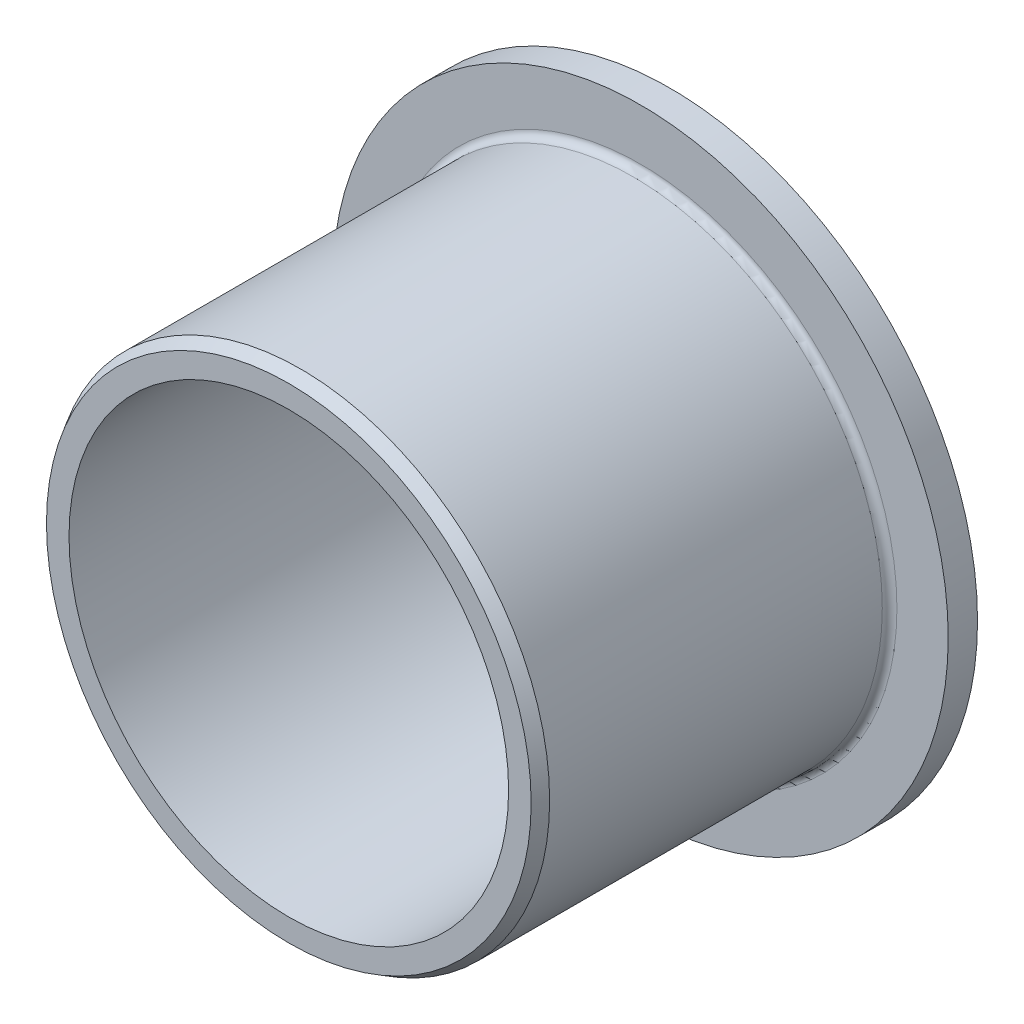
ISO-10303-21;
HEADER;
FILE_DESCRIPTION(('STEP AP214'),'2;1');
FILE_NAME('part.step','',(''),(''),'','','');
FILE_SCHEMA(('AUTOMOTIVE_DESIGN { 1 0 10303 214 1 1 1 1 }'));
ENDSEC;
DATA;
#1=APPLICATION_CONTEXT('core data for automotive mechanical design processes');
#2=APPLICATION_PROTOCOL_DEFINITION('international standard','automotive_design',2000,#1);
#3=PRODUCT_CONTEXT('',#1,'mechanical');
#4=PRODUCT('Part','Part','',(#3));
#5=PRODUCT_RELATED_PRODUCT_CATEGORY('part','',(#4));
#6=PRODUCT_DEFINITION_FORMATION('','',#4);
#7=PRODUCT_DEFINITION_CONTEXT('part definition',#1,'design');
#8=PRODUCT_DEFINITION('design','',#6,#7);
#9=PRODUCT_DEFINITION_SHAPE('','',#8);
#10=(LENGTH_UNIT() NAMED_UNIT(*) SI_UNIT(.MILLI.,.METRE.));
#11=(NAMED_UNIT(*) PLANE_ANGLE_UNIT() SI_UNIT($,.RADIAN.));
#12=(NAMED_UNIT(*) SI_UNIT($,.STERADIAN.) SOLID_ANGLE_UNIT());
#13=UNCERTAINTY_MEASURE_WITH_UNIT(LENGTH_MEASURE(1.E-05),#10,'distance_accuracy_value','');
#14=(GEOMETRIC_REPRESENTATION_CONTEXT(3) GLOBAL_UNCERTAINTY_ASSIGNED_CONTEXT((#13)) GLOBAL_UNIT_ASSIGNED_CONTEXT((#10,
#11,#12)) REPRESENTATION_CONTEXT('',''));
#15=CARTESIAN_POINT('',(0.,0.,0.));
#16=DIRECTION('',(0.,0.,1.));
#17=DIRECTION('',(1.,0.,0.));
#18=AXIS2_PLACEMENT_3D('',#15,#16,#17);
#19=CARTESIAN_POINT('',(0.,0.,26.));
#20=DIRECTION('',(0.,0.,1.));
#21=DIRECTION('',(1.,0.,0.));
#22=AXIS2_PLACEMENT_3D('',#19,#20,#21);
#23=PLANE('',#22);
#24=CARTESIAN_POINT('',(0.,0.,26.));
#25=DIRECTION('',(0.,0.,1.));
#26=DIRECTION('',(1.,0.,0.));
#27=AXIS2_PLACEMENT_3D('',#24,#25,#26);
#28=CIRCLE('',#27,16.5381197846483);
#29=CARTESIAN_POINT('',(16.5381197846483,0.,26.));
#30=VERTEX_POINT('',#29);
#31=EDGE_CURVE('E353',#30,#30,#28,.T.);
#32=ORIENTED_EDGE('',*,*,#31,.T.);
#33=EDGE_LOOP('',(#32));
#34=FACE_BOUND('',#33,.T.);
#35=CARTESIAN_POINT('',(0.,0.,26.));
#36=DIRECTION('',(0.,0.,1.));
#37=DIRECTION('',(1.,0.,0.));
#38=AXIS2_PLACEMENT_3D('',#35,#36,#37);
#39=CIRCLE('',#38,15.);
#40=CARTESIAN_POINT('',(-15.,0.,26.));
#41=VERTEX_POINT('',#40);
#42=EDGE_CURVE('E369',#41,#41,#39,.T.);
#43=ORIENTED_EDGE('',*,*,#42,.F.);
#44=EDGE_LOOP('',(#43));
#45=FACE_BOUND('',#44,.T.);
#46=ADVANCED_FACE('F346',(#34,#45),#23,.T.);
#47=CARTESIAN_POINT('',(0.,0.,26.));
#48=DIRECTION('',(0.,0.,-1.));
#49=DIRECTION('',(-1.,0.,0.));
#50=AXIS2_PLACEMENT_3D('',#47,#48,#49);
#51=CYLINDRICAL_SURFACE('',#50,21.);
#52=CARTESIAN_POINT('',(0.,0.,0.));
#53=DIRECTION('',(0.,0.,1.));
#54=DIRECTION('',(1.,0.,0.));
#55=AXIS2_PLACEMENT_3D('',#52,#53,#54);
#56=CIRCLE('',#55,21.);
#57=CARTESIAN_POINT('',(-21.,0.,0.));
#58=VERTEX_POINT('',#57);
#59=EDGE_CURVE('E366',#58,#58,#56,.T.);
#60=CARTESIAN_POINT('',(0.,0.,2.));
#61=DIRECTION('',(0.,0.,1.));
#62=DIRECTION('',(1.,0.,0.));
#63=AXIS2_PLACEMENT_3D('',#60,#61,#62);
#64=CIRCLE('',#63,21.);
#65=CARTESIAN_POINT('',(-21.,0.,1.99999999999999));
#66=VERTEX_POINT('',#65);
#67=EDGE_CURVE('E375',#66,#66,#64,.T.);
#68=CARTESIAN_POINT('',(-21.,0.,0.));
#69=CARTESIAN_POINT('',(-21.,0.,0.0208333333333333));
#70=CARTESIAN_POINT('',(-21.,0.,0.0416666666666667));
#71=CARTESIAN_POINT('',(-21.,0.,0.0833333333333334));
#72=CARTESIAN_POINT('',(-21.,0.,0.104166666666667));
#73=CARTESIAN_POINT('',(-21.,0.,0.145833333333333));
#74=CARTESIAN_POINT('',(-21.,0.,0.166666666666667));
#75=CARTESIAN_POINT('',(-21.,0.,0.208333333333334));
#76=CARTESIAN_POINT('',(-21.,0.,0.229166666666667));
#77=CARTESIAN_POINT('',(-21.,0.,0.270833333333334));
#78=CARTESIAN_POINT('',(-21.,0.,0.291666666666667));
#79=CARTESIAN_POINT('',(-21.,0.,0.333333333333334));
#80=CARTESIAN_POINT('',(-21.,0.,0.354166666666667));
#81=CARTESIAN_POINT('',(-21.,0.,0.395833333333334));
#82=CARTESIAN_POINT('',(-21.,0.,0.416666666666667));
#83=CARTESIAN_POINT('',(-21.,0.,0.458333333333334));
#84=CARTESIAN_POINT('',(-21.,0.,0.479166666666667));
#85=CARTESIAN_POINT('',(-21.,0.,0.520833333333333));
#86=CARTESIAN_POINT('',(-21.,0.,0.541666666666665));
#87=CARTESIAN_POINT('',(-21.,0.,0.58333333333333));
#88=CARTESIAN_POINT('',(-21.,0.,0.604166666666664));
#89=CARTESIAN_POINT('',(-21.,0.,0.64583333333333));
#90=CARTESIAN_POINT('',(-21.,0.,0.666666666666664));
#91=CARTESIAN_POINT('',(-21.,0.,0.70833333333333));
#92=CARTESIAN_POINT('',(-21.,0.,0.729166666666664));
#93=CARTESIAN_POINT('',(-21.,0.,0.77083333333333));
#94=CARTESIAN_POINT('',(-21.,0.,0.791666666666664));
#95=CARTESIAN_POINT('',(-21.,0.,0.833333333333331));
#96=CARTESIAN_POINT('',(-21.,0.,0.854166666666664));
#97=CARTESIAN_POINT('',(-21.,0.,0.895833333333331));
#98=CARTESIAN_POINT('',(-21.,0.,0.916666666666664));
#99=CARTESIAN_POINT('',(-21.,0.,0.958333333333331));
#100=CARTESIAN_POINT('',(-21.,0.,0.979166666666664));
#101=CARTESIAN_POINT('',(-21.,0.,1.02083333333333));
#102=CARTESIAN_POINT('',(-21.,0.,1.04166666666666));
#103=CARTESIAN_POINT('',(-21.,0.,1.08333333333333));
#104=CARTESIAN_POINT('',(-21.,0.,1.10416666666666));
#105=CARTESIAN_POINT('',(-21.,0.,1.14583333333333));
#106=CARTESIAN_POINT('',(-21.,0.,1.16666666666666));
#107=CARTESIAN_POINT('',(-21.,0.,1.20833333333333));
#108=CARTESIAN_POINT('',(-21.,0.,1.22916666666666));
#109=CARTESIAN_POINT('',(-21.,0.,1.27083333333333));
#110=CARTESIAN_POINT('',(-21.,0.,1.29166666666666));
#111=CARTESIAN_POINT('',(-21.,0.,1.33333333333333));
#112=CARTESIAN_POINT('',(-21.,0.,1.35416666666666));
#113=CARTESIAN_POINT('',(-21.,0.,1.39583333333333));
#114=CARTESIAN_POINT('',(-21.,0.,1.41666666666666));
#115=CARTESIAN_POINT('',(-21.,0.,1.45833333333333));
#116=CARTESIAN_POINT('',(-21.,0.,1.47916666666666));
#117=CARTESIAN_POINT('',(-21.,0.,1.52083333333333));
#118=CARTESIAN_POINT('',(-21.,0.,1.54166666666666));
#119=CARTESIAN_POINT('',(-21.,0.,1.58333333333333));
#120=CARTESIAN_POINT('',(-21.,0.,1.60416666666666));
#121=CARTESIAN_POINT('',(-21.,0.,1.64583333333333));
#122=CARTESIAN_POINT('',(-21.,0.,1.66666666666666));
#123=CARTESIAN_POINT('',(-21.,0.,1.70833333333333));
#124=CARTESIAN_POINT('',(-21.,0.,1.72916666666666));
#125=CARTESIAN_POINT('',(-21.,0.,1.77083333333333));
#126=CARTESIAN_POINT('',(-21.,0.,1.79166666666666));
#127=CARTESIAN_POINT('',(-21.,0.,1.83333333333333));
#128=CARTESIAN_POINT('',(-21.,0.,1.85416666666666));
#129=CARTESIAN_POINT('',(-21.,0.,1.89583333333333));
#130=CARTESIAN_POINT('',(-21.,0.,1.91666666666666));
#131=CARTESIAN_POINT('',(-21.,0.,1.95833333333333));
#132=CARTESIAN_POINT('',(-21.,0.,1.97916666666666));
#133=CARTESIAN_POINT('',(-21.,0.,1.99999999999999));
#134=B_SPLINE_CURVE_WITH_KNOTS('',3,(#68,#69,#70,#71,#72,#73,#74,#75,#76,#77,#78,#79,#80,#81,
#82,#83,#84,#85,#86,#87,#88,#89,#90,#91,#92,#93,#94,#95,#96,#97,#98,#99,#100,#101,#102,#103,
#104,#105,#106,#107,#108,#109,#110,#111,#112,#113,#114,#115,#116,#117,#118,#119,#120,#121,#122,
#123,#124,#125,#126,#127,#128,#129,#130,#131,#132,#133),.UNSPECIFIED.,.F.,.F.,(4,2,2,2,2,2,2,2,
2,2,2,2,2,2,2,2,2,2,2,2,2,2,2,2,2,2,2,2,2,2,2,2,4),(0.,0.0625000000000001,0.125,0.1875,0.25,
0.3125,0.375,0.4375,0.5,0.562499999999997,0.624999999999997,0.687499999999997,0.749999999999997,
0.812499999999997,0.874999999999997,0.937499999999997,0.999999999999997,1.0625,1.125,1.1875,
1.25,1.3125,1.375,1.4375,1.49999999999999,1.56249999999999,1.62499999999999,1.68749999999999,
1.74999999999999,1.81249999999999,1.87499999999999,1.93749999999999,1.99999999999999),.UNSPECIFIED.);
#135=EDGE_CURVE('BSEAM348',#58,#66,#134,.T.);
#136=ORIENTED_EDGE('',*,*,#59,.T.);
#137=ORIENTED_EDGE('',*,*,#67,.F.);
#138=ORIENTED_EDGE('',*,*,#135,.T.);
#139=ORIENTED_EDGE('',*,*,#135,.F.);
#140=EDGE_LOOP('',(#136,#138,#137,#139));
#141=FACE_BOUND('',#140,.T.);
#142=ADVANCED_FACE('F348',(#141),#51,.T.);
#143=CARTESIAN_POINT('',(0.,0.,0.));
#144=DIRECTION('',(0.,0.,1.));
#145=DIRECTION('',(1.,0.,0.));
#146=AXIS2_PLACEMENT_3D('',#143,#144,#145);
#147=PLANE('',#146);
#148=ORIENTED_EDGE('',*,*,#59,.F.);
#149=EDGE_LOOP('',(#148));
#150=FACE_BOUND('',#149,.T.);
#151=CARTESIAN_POINT('',(0.,0.,0.));
#152=DIRECTION('',(0.,0.,1.));
#153=DIRECTION('',(1.,0.,0.));
#154=AXIS2_PLACEMENT_3D('',#151,#152,#153);
#155=CIRCLE('',#154,15.);
#156=CARTESIAN_POINT('',(-15.,0.,0.));
#157=VERTEX_POINT('',#156);
#158=EDGE_CURVE('E372',#157,#157,#155,.T.);
#159=ORIENTED_EDGE('',*,*,#158,.T.);
#160=EDGE_LOOP('',(#159));
#161=FACE_BOUND('',#160,.T.);
#162=ADVANCED_FACE('F382',(#150,#161),#147,.F.);
#163=CARTESIAN_POINT('',(0.,0.,26.));
#164=DIRECTION('',(0.,0.,-1.));
#165=DIRECTION('',(-1.,0.,0.));
#166=AXIS2_PLACEMENT_3D('',#163,#164,#165);
#167=CYLINDRICAL_SURFACE('',#166,15.);
#168=CARTESIAN_POINT('',(-15.,0.,26.));
#169=CARTESIAN_POINT('',(-15.,0.,25.7291666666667));
#170=CARTESIAN_POINT('',(-15.,0.,25.4583333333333));
#171=CARTESIAN_POINT('',(-15.,0.,24.9166666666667));
#172=CARTESIAN_POINT('',(-15.,0.,24.6458333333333));
#173=CARTESIAN_POINT('',(-15.,0.,24.1041666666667));
#174=CARTESIAN_POINT('',(-15.,0.,23.8333333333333));
#175=CARTESIAN_POINT('',(-15.,0.,23.2916666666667));
#176=CARTESIAN_POINT('',(-15.,0.,23.0208333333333));
#177=CARTESIAN_POINT('',(-15.,0.,22.4791666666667));
#178=CARTESIAN_POINT('',(-15.,0.,22.2083333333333));
#179=CARTESIAN_POINT('',(-15.,0.,21.6666666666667));
#180=CARTESIAN_POINT('',(-15.,0.,21.3958333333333));
#181=CARTESIAN_POINT('',(-15.,0.,20.8541666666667));
#182=CARTESIAN_POINT('',(-15.,0.,20.5833333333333));
#183=CARTESIAN_POINT('',(-15.,0.,20.0416666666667));
#184=CARTESIAN_POINT('',(-15.,0.,19.7708333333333));
#185=CARTESIAN_POINT('',(-15.,0.,19.2291666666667));
#186=CARTESIAN_POINT('',(-15.,0.,18.9583333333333));
#187=CARTESIAN_POINT('',(-15.,0.,18.4166666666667));
#188=CARTESIAN_POINT('',(-15.,0.,18.1458333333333));
#189=CARTESIAN_POINT('',(-15.,0.,17.6041666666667));
#190=CARTESIAN_POINT('',(-15.,0.,17.3333333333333));
#191=CARTESIAN_POINT('',(-15.,0.,16.7916666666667));
#192=CARTESIAN_POINT('',(-15.,0.,16.5208333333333));
#193=CARTESIAN_POINT('',(-15.,0.,15.9791666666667));
#194=CARTESIAN_POINT('',(-15.,0.,15.7083333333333));
#195=CARTESIAN_POINT('',(-15.,0.,15.1666666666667));
#196=CARTESIAN_POINT('',(-15.,0.,14.8958333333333));
#197=CARTESIAN_POINT('',(-15.,0.,14.3541666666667));
#198=CARTESIAN_POINT('',(-15.,0.,14.0833333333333));
#199=CARTESIAN_POINT('',(-15.,0.,13.5416666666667));
#200=CARTESIAN_POINT('',(-15.,0.,13.2708333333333));
#201=CARTESIAN_POINT('',(-15.,0.,12.7291666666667));
#202=CARTESIAN_POINT('',(-15.,0.,12.4583333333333));
#203=CARTESIAN_POINT('',(-15.,0.,11.9166666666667));
#204=CARTESIAN_POINT('',(-15.,0.,11.6458333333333));
#205=CARTESIAN_POINT('',(-15.,0.,11.1041666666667));
#206=CARTESIAN_POINT('',(-15.,0.,10.8333333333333));
#207=CARTESIAN_POINT('',(-15.,0.,10.2916666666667));
#208=CARTESIAN_POINT('',(-15.,0.,10.0208333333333));
#209=CARTESIAN_POINT('',(-15.,0.,9.47916666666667));
#210=CARTESIAN_POINT('',(-15.,0.,9.20833333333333));
#211=CARTESIAN_POINT('',(-15.,0.,8.66666666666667));
#212=CARTESIAN_POINT('',(-15.,0.,8.39583333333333));
#213=CARTESIAN_POINT('',(-15.,0.,7.85416666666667));
#214=CARTESIAN_POINT('',(-15.,0.,7.58333333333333));
#215=CARTESIAN_POINT('',(-15.,0.,7.04166666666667));
#216=CARTESIAN_POINT('',(-15.,0.,6.77083333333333));
#217=CARTESIAN_POINT('',(-15.,0.,6.22916666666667));
#218=CARTESIAN_POINT('',(-15.,0.,5.95833333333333));
#219=CARTESIAN_POINT('',(-15.,0.,5.41666666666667));
#220=CARTESIAN_POINT('',(-15.,0.,5.14583333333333));
#221=CARTESIAN_POINT('',(-15.,0.,4.60416666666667));
#222=CARTESIAN_POINT('',(-15.,0.,4.33333333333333));
#223=CARTESIAN_POINT('',(-15.,0.,3.79166666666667));
#224=CARTESIAN_POINT('',(-15.,0.,3.52083333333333));
#225=CARTESIAN_POINT('',(-15.,0.,2.97916666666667));
#226=CARTESIAN_POINT('',(-15.,0.,2.70833333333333));
#227=CARTESIAN_POINT('',(-15.,0.,2.16666666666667));
#228=CARTESIAN_POINT('',(-15.,0.,1.89583333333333));
#229=CARTESIAN_POINT('',(-15.,0.,1.35416666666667));
#230=CARTESIAN_POINT('',(-15.,0.,1.08333333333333));
#231=CARTESIAN_POINT('',(-15.,0.,0.541666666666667));
#232=CARTESIAN_POINT('',(-15.,0.,0.270833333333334));
#233=CARTESIAN_POINT('',(-15.,0.,0.));
#234=B_SPLINE_CURVE_WITH_KNOTS('',3,(#168,#169,#170,#171,#172,#173,#174,#175,#176,#177,#178,
#179,#180,#181,#182,#183,#184,#185,#186,#187,#188,#189,#190,#191,#192,#193,#194,#195,#196,#197,
#198,#199,#200,#201,#202,#203,#204,#205,#206,#207,#208,#209,#210,#211,#212,#213,#214,#215,#216,
#217,#218,#219,#220,#221,#222,#223,#224,#225,#226,#227,#228,#229,#230,#231,#232,#233),
.UNSPECIFIED.,.F.,.F.,(4,2,2,2,2,2,2,2,2,2,2,2,2,2,2,2,2,2,2,2,2,2,2,2,2,2,2,2,2,2,2,2,4),(0.,
0.812500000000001,1.625,2.4375,3.25,4.0625,4.875,5.6875,6.5,7.3125,8.125,8.9375,9.75,10.5625,
11.375,12.1875,13.,13.8125,14.625,15.4375,16.25,17.0625,17.875,18.6875,19.5,20.3125,21.125,
21.9375,22.75,23.5625,24.375,25.1875,26.),.UNSPECIFIED.);
#235=EDGE_CURVE('BSEAM388',#41,#157,#234,.T.);
#236=ORIENTED_EDGE('',*,*,#42,.T.);
#237=ORIENTED_EDGE('',*,*,#158,.F.);
#238=ORIENTED_EDGE('',*,*,#235,.T.);
#239=ORIENTED_EDGE('',*,*,#235,.F.);
#240=EDGE_LOOP('',(#236,#238,#237,#239));
#241=FACE_BOUND('',#240,.T.);
#242=ADVANCED_FACE('F388',(#241),#167,.F.);
#243=CARTESIAN_POINT('',(0.,0.,2.));
#244=DIRECTION('',(0.,0.,1.));
#245=DIRECTION('',(1.,0.,0.));
#246=AXIS2_PLACEMENT_3D('',#243,#244,#245);
#247=PLANE('',#246);
#248=CARTESIAN_POINT('',(0.,0.,2.));
#249=DIRECTION('',(0.,0.,1.));
#250=DIRECTION('',(1.,0.,0.));
#251=AXIS2_PLACEMENT_3D('',#248,#249,#250);
#252=CIRCLE('',#251,17.5);
#253=CARTESIAN_POINT('',(17.5,0.,2.));
#254=VERTEX_POINT('',#253);
#255=EDGE_CURVE('E357',#254,#254,#252,.F.);
#256=ORIENTED_EDGE('',*,*,#255,.T.);
#257=EDGE_LOOP('',(#256));
#258=FACE_BOUND('',#257,.T.);
#259=ORIENTED_EDGE('',*,*,#67,.T.);
#260=EDGE_LOOP('',(#259));
#261=FACE_BOUND('',#260,.T.);
#262=ADVANCED_FACE('F379',(#258,#261),#247,.T.);
#263=CARTESIAN_POINT('',(0.,0.,2.));
#264=DIRECTION('',(0.,0.,1.));
#265=DIRECTION('',(1.,0.,0.));
#266=AXIS2_PLACEMENT_3D('',#263,#264,#265);
#267=CYLINDRICAL_SURFACE('',#266,17.);
#268=CARTESIAN_POINT('',(0.,0.,25.2));
#269=DIRECTION('',(0.,0.,1.));
#270=DIRECTION('',(1.,0.,0.));
#271=AXIS2_PLACEMENT_3D('',#268,#269,#270);
#272=CIRCLE('',#271,17.);
#273=CARTESIAN_POINT('',(17.,0.,25.2));
#274=VERTEX_POINT('',#273);
#275=EDGE_CURVE('E10',#274,#274,#272,.F.);
#276=ORIENTED_EDGE('',*,*,#275,.T.);
#277=EDGE_LOOP('',(#276));
#278=FACE_BOUND('',#277,.T.);
#279=CARTESIAN_POINT('',(0.,0.,2.5));
#280=DIRECTION('',(0.,0.,1.));
#281=DIRECTION('',(1.,0.,0.));
#282=AXIS2_PLACEMENT_3D('',#279,#280,#281);
#283=CIRCLE('',#282,17.);
#284=CARTESIAN_POINT('',(17.,0.,2.5));
#285=VERTEX_POINT('',#284);
#286=EDGE_CURVE('E361',#285,#285,#283,.T.);
#287=ORIENTED_EDGE('',*,*,#286,.T.);
#288=EDGE_LOOP('',(#287));
#289=FACE_BOUND('',#288,.T.);
#290=ADVANCED_FACE('F401',(#278,#289),#267,.T.);
#291=CARTESIAN_POINT('',(0.,0.,2.5));
#292=DIRECTION('',(0.,0.,1.));
#293=DIRECTION('',(1.,0.,0.));
#294=AXIS2_PLACEMENT_3D('',#291,#292,#293);
#295=TOROIDAL_SURFACE('',#294,17.5,0.5);
#296=ORIENTED_EDGE('',*,*,#255,.F.);
#297=EDGE_LOOP('',(#296));
#298=FACE_BOUND('',#297,.T.);
#299=ORIENTED_EDGE('',*,*,#286,.F.);
#300=EDGE_LOOP('',(#299));
#301=FACE_BOUND('',#300,.T.);
#302=ADVANCED_FACE('F407',(#298,#301),#295,.F.);
#303=CARTESIAN_POINT('',(0.,0.,26.));
#304=DIRECTION('',(0.,0.,-1.));
#305=DIRECTION('',(-1.,0.,0.));
#306=AXIS2_PLACEMENT_3D('',#303,#304,#305);
#307=CONICAL_SURFACE('',#306,16.5381197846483,0.523598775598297);
#308=ORIENTED_EDGE('',*,*,#275,.F.);
#309=EDGE_LOOP('',(#308));
#310=FACE_BOUND('',#309,.T.);
#311=ORIENTED_EDGE('',*,*,#31,.F.);
#312=EDGE_LOOP('',(#311));
#313=FACE_BOUND('',#312,.T.);
#314=ADVANCED_FACE('F410',(#310,#313),#307,.T.);
#315=CLOSED_SHELL('',(#46,#142,#162,#242,#262,#290,#302,#314));
#316=MANIFOLD_SOLID_BREP('B2',#315);
#317=ADVANCED_BREP_SHAPE_REPRESENTATION('',(#18,#316),#14);
#318=SHAPE_DEFINITION_REPRESENTATION(#9,#317);
ENDSEC;
END-ISO-10303-21;
